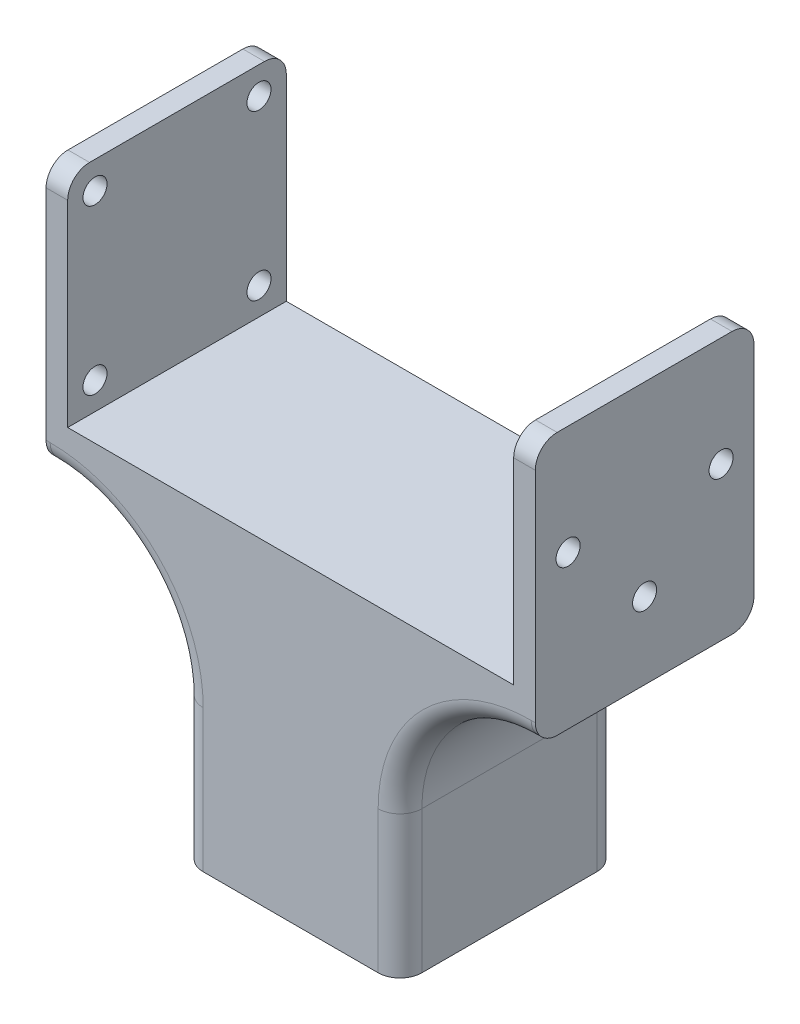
ISO-10303-21;
HEADER;
FILE_DESCRIPTION(('STEP AP214'),'2;1');
FILE_NAME('part.step','',(''),(''),'','','');
FILE_SCHEMA(('AUTOMOTIVE_DESIGN { 1 0 10303 214 1 1 1 1 }'));
ENDSEC;
DATA;
#1=APPLICATION_CONTEXT('core data for automotive mechanical design processes');
#2=APPLICATION_PROTOCOL_DEFINITION('international standard','automotive_design',2000,#1);
#3=PRODUCT_CONTEXT('',#1,'mechanical');
#4=PRODUCT('Part','Part','',(#3));
#5=PRODUCT_RELATED_PRODUCT_CATEGORY('part','',(#4));
#6=PRODUCT_DEFINITION_FORMATION('','',#4);
#7=PRODUCT_DEFINITION_CONTEXT('part definition',#1,'design');
#8=PRODUCT_DEFINITION('design','',#6,#7);
#9=PRODUCT_DEFINITION_SHAPE('','',#8);
#10=(LENGTH_UNIT() NAMED_UNIT(*) SI_UNIT(.MILLI.,.METRE.));
#11=(NAMED_UNIT(*) PLANE_ANGLE_UNIT() SI_UNIT($,.RADIAN.));
#12=(NAMED_UNIT(*) SI_UNIT($,.STERADIAN.) SOLID_ANGLE_UNIT());
#13=UNCERTAINTY_MEASURE_WITH_UNIT(LENGTH_MEASURE(1.E-05),#10,'distance_accuracy_value','');
#14=(GEOMETRIC_REPRESENTATION_CONTEXT(3) GLOBAL_UNCERTAINTY_ASSIGNED_CONTEXT((#13)) GLOBAL_UNIT_ASSIGNED_CONTEXT((#10,
#11,#12)) REPRESENTATION_CONTEXT('',''));
#15=CARTESIAN_POINT('',(0.,0.,0.));
#16=DIRECTION('',(0.,0.,1.));
#17=DIRECTION('',(1.,0.,0.));
#18=AXIS2_PLACEMENT_3D('',#15,#16,#17);
#19=CARTESIAN_POINT('',(0.,25.,0.));
#20=DIRECTION('',(0.,1.,0.));
#21=DIRECTION('',(1.,0.,0.));
#22=AXIS2_PLACEMENT_3D('',#19,#20,#21);
#23=PLANE('',#22);
#24=CARTESIAN_POINT('',(0.,25.,0.));
#25=DIRECTION('',(0.,-1.,0.));
#26=DIRECTION('',(1.,0.,0.));
#27=AXIS2_PLACEMENT_3D('',#24,#25,#26);
#28=CIRCLE('',#27,8.4);
#29=CARTESIAN_POINT('',(-8.4,25.,0.));
#30=VERTEX_POINT('',#29);
#31=EDGE_CURVE('E307',#30,#30,#28,.T.);
#32=ORIENTED_EDGE('',*,*,#31,.T.);
#33=EDGE_LOOP('',(#32));
#34=FACE_BOUND('',#33,.T.);
#35=ADVANCED_FACE('F15',(#34),#23,.F.);
#36=CARTESIAN_POINT('',(0.,49.,0.));
#37=DIRECTION('',(0.,1.,0.));
#38=DIRECTION('',(1.,0.,0.));
#39=AXIS2_PLACEMENT_3D('',#36,#37,#38);
#40=PLANE('',#39);
#41=DIRECTION('',(-1.,0.,0.));
#42=VECTOR('',#41,1.);
#43=CARTESIAN_POINT('',(-5.,49.,8.));
#44=LINE('',#43,#42);
#45=CARTESIAN_POINT('',(-20.4,49.,8.));
#46=VERTEX_POINT('',#45);
#47=CARTESIAN_POINT('',(-22.375,49.,8.));
#48=VERTEX_POINT('',#47);
#49=EDGE_CURVE('E421',#46,#48,#44,.T.);
#50=ORIENTED_EDGE('',*,*,#49,.F.);
#51=DIRECTION('',(0.,0.,-1.));
#52=VECTOR('',#51,1.);
#53=CARTESIAN_POINT('',(-20.4,49.,10.173540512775));
#54=LINE('',#53,#52);
#55=CARTESIAN_POINT('',(-20.4,49.,-8.));
#56=VERTEX_POINT('',#55);
#57=EDGE_CURVE('E10',#46,#56,#54,.T.);
#58=ORIENTED_EDGE('',*,*,#57,.T.);
#59=DIRECTION('',(1.,0.,0.));
#60=VECTOR('',#59,1.);
#61=CARTESIAN_POINT('',(5.,49.,-8.));
#62=LINE('',#61,#60);
#63=CARTESIAN_POINT('',(-22.375,49.,-8.));
#64=VERTEX_POINT('',#63);
#65=EDGE_CURVE('E350',#64,#56,#62,.T.);
#66=ORIENTED_EDGE('',*,*,#65,.F.);
#67=DIRECTION('',(0.,0.,1.));
#68=VECTOR('',#67,1.);
#69=CARTESIAN_POINT('',(-22.375,49.,-10.));
#70=LINE('',#69,#68);
#71=EDGE_CURVE('E577',#64,#48,#70,.T.);
#72=ORIENTED_EDGE('',*,*,#71,.T.);
#73=EDGE_LOOP('',(#50,#58,#66,#72));
#74=FACE_BOUND('',#73,.T.);
#75=ADVANCED_FACE('F1269',(#74),#40,.T.);
#76=CARTESIAN_POINT('',(0.,29.,0.));
#77=DIRECTION('',(0.,-1.,0.));
#78=DIRECTION('',(0.,0.,-1.));
#79=AXIS2_PLACEMENT_3D('',#76,#77,#78);
#80=PLANE('',#79);
#81=DIRECTION('',(1.,0.,0.));
#82=VECTOR('',#81,1.);
#83=CARTESIAN_POINT('',(5.,29.,-10.));
#84=LINE('',#83,#82);
#85=CARTESIAN_POINT('',(-20.4,29.,-10.));
#86=VERTEX_POINT('',#85);
#87=CARTESIAN_POINT('',(20.4,29.,-10.));
#88=VERTEX_POINT('',#87);
#89=EDGE_CURVE('E445',#86,#88,#84,.T.);
#90=ORIENTED_EDGE('',*,*,#89,.F.);
#91=DIRECTION('',(0.,0.,-1.));
#92=VECTOR('',#91,1.);
#93=CARTESIAN_POINT('',(-20.4,29.,-20.34708102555));
#94=LINE('',#93,#92);
#95=CARTESIAN_POINT('',(-20.4,29.,10.));
#96=VERTEX_POINT('',#95);
#97=EDGE_CURVE('E26',#96,#86,#94,.T.);
#98=ORIENTED_EDGE('',*,*,#97,.F.);
#99=DIRECTION('',(-1.,0.,0.));
#100=VECTOR('',#99,1.);
#101=CARTESIAN_POINT('',(-5.,29.,10.));
#102=LINE('',#101,#100);
#103=CARTESIAN_POINT('',(20.4,29.,10.));
#104=VERTEX_POINT('',#103);
#105=EDGE_CURVE('E498',#104,#96,#102,.T.);
#106=ORIENTED_EDGE('',*,*,#105,.F.);
#107=DIRECTION('',(0.,0.,1.));
#108=VECTOR('',#107,1.);
#109=CARTESIAN_POINT('',(20.4,29.,20.34708102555));
#110=LINE('',#109,#108);
#111=EDGE_CURVE('E347',#88,#104,#110,.T.);
#112=ORIENTED_EDGE('',*,*,#111,.F.);
#113=EDGE_LOOP('',(#90,#98,#106,#112));
#114=FACE_BOUND('',#113,.T.);
#115=ADVANCED_FACE('F874',(#114),#80,.F.);
#116=CARTESIAN_POINT('',(-20.4,49.,20.34708102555));
#117=DIRECTION('',(-1.,0.,0.));
#118=DIRECTION('',(0.,0.,1.));
#119=AXIS2_PLACEMENT_3D('',#116,#117,#118);
#120=PLANE('',#119);
#121=CARTESIAN_POINT('',(-20.4,31.5,7.5));
#122=DIRECTION('',(-1.,0.,0.));
#123=DIRECTION('',(0.,0.,1.));
#124=AXIS2_PLACEMENT_3D('',#121,#122,#123);
#125=CIRCLE('',#124,1.1);
#126=CARTESIAN_POINT('',(-20.4,31.5,6.4));
#127=VERTEX_POINT('',#126);
#128=EDGE_CURVE('E38',#127,#127,#125,.T.);
#129=ORIENTED_EDGE('',*,*,#128,.T.);
#130=EDGE_LOOP('',(#129));
#131=FACE_BOUND('',#130,.T.);
#132=CARTESIAN_POINT('',(-20.4,31.5,-7.5));
#133=DIRECTION('',(-1.,0.,0.));
#134=DIRECTION('',(0.,0.,1.));
#135=AXIS2_PLACEMENT_3D('',#132,#133,#134);
#136=CIRCLE('',#135,1.1);
#137=CARTESIAN_POINT('',(-20.4,31.5,-8.6));
#138=VERTEX_POINT('',#137);
#139=EDGE_CURVE('E589',#138,#138,#136,.T.);
#140=ORIENTED_EDGE('',*,*,#139,.T.);
#141=EDGE_LOOP('',(#140));
#142=FACE_BOUND('',#141,.T.);
#143=CARTESIAN_POINT('',(-20.4,46.5,-7.5));
#144=DIRECTION('',(-1.,0.,0.));
#145=DIRECTION('',(0.,0.,1.));
#146=AXIS2_PLACEMENT_3D('',#143,#144,#145);
#147=CIRCLE('',#146,1.1);
#148=CARTESIAN_POINT('',(-20.4,46.5,-8.6));
#149=VERTEX_POINT('',#148);
#150=EDGE_CURVE('E428',#149,#149,#147,.T.);
#151=ORIENTED_EDGE('',*,*,#150,.T.);
#152=EDGE_LOOP('',(#151));
#153=FACE_BOUND('',#152,.T.);
#154=CARTESIAN_POINT('',(-20.4,46.5,7.5));
#155=DIRECTION('',(-1.,0.,0.));
#156=DIRECTION('',(0.,0.,1.));
#157=AXIS2_PLACEMENT_3D('',#154,#155,#156);
#158=CIRCLE('',#157,1.1);
#159=CARTESIAN_POINT('',(-20.4,46.5,6.4));
#160=VERTEX_POINT('',#159);
#161=EDGE_CURVE('E463',#160,#160,#158,.T.);
#162=ORIENTED_EDGE('',*,*,#161,.T.);
#163=EDGE_LOOP('',(#162));
#164=FACE_BOUND('',#163,.T.);
#165=CARTESIAN_POINT('',(-20.4,47.,8.));
#166=DIRECTION('',(-1.,0.,0.));
#167=DIRECTION('',(0.,0.707106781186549,0.707106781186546));
#168=AXIS2_PLACEMENT_3D('',#165,#166,#167);
#169=CIRCLE('',#168,2.);
#170=CARTESIAN_POINT('',(-20.4,47.,10.));
#171=VERTEX_POINT('',#170);
#172=EDGE_CURVE('E489',#171,#46,#169,.T.);
#173=ORIENTED_EDGE('',*,*,#172,.F.);
#174=DIRECTION('',(0.,1.,0.));
#175=VECTOR('',#174,1.);
#176=CARTESIAN_POINT('',(-20.4,24.5,10.));
#177=LINE('',#176,#175);
#178=EDGE_CURVE('E502',#96,#171,#177,.T.);
#179=ORIENTED_EDGE('',*,*,#178,.F.);
#180=ORIENTED_EDGE('',*,*,#97,.T.);
#181=DIRECTION('',(0.,-1.,0.));
#182=VECTOR('',#181,1.);
#183=CARTESIAN_POINT('',(-20.4,24.5,-10.));
#184=LINE('',#183,#182);
#185=CARTESIAN_POINT('',(-20.4,47.,-10.));
#186=VERTEX_POINT('',#185);
#187=EDGE_CURVE('E531',#186,#86,#184,.T.);
#188=ORIENTED_EDGE('',*,*,#187,.F.);
#189=CARTESIAN_POINT('',(-20.4,47.,-8.));
#190=DIRECTION('',(-1.,0.,0.));
#191=DIRECTION('',(0.,0.707106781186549,-0.707106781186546));
#192=AXIS2_PLACEMENT_3D('',#189,#190,#191);
#193=CIRCLE('',#192,2.);
#194=EDGE_CURVE('E354',#56,#186,#193,.T.);
#195=ORIENTED_EDGE('',*,*,#194,.F.);
#196=ORIENTED_EDGE('',*,*,#57,.F.);
#197=EDGE_LOOP('',(#173,#179,#180,#188,#195,#196));
#198=FACE_BOUND('',#197,.T.);
#199=ADVANCED_FACE('F878',(#131,#142,#153,#164,#198),#120,.F.);
#200=CARTESIAN_POINT('',(20.4,49.,-20.34708102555));
#201=DIRECTION('',(1.,0.,0.));
#202=DIRECTION('',(0.,1.,0.));
#203=AXIS2_PLACEMENT_3D('',#200,#201,#202);
#204=PLANE('',#203);
#205=CARTESIAN_POINT('',(20.4,32.,0.));
#206=DIRECTION('',(1.,0.,0.));
#207=DIRECTION('',(0.,0.,-1.));
#208=AXIS2_PLACEMENT_3D('',#205,#206,#207);
#209=CIRCLE('',#208,1.1);
#210=CARTESIAN_POINT('',(20.4,32.,1.1));
#211=VERTEX_POINT('',#210);
#212=EDGE_CURVE('E330',#211,#211,#209,.T.);
#213=ORIENTED_EDGE('',*,*,#212,.T.);
#214=EDGE_LOOP('',(#213));
#215=FACE_BOUND('',#214,.T.);
#216=CARTESIAN_POINT('',(20.4,39.,7.));
#217=DIRECTION('',(1.,0.,0.));
#218=DIRECTION('',(0.,0.,-1.));
#219=AXIS2_PLACEMENT_3D('',#216,#217,#218);
#220=CIRCLE('',#219,1.1);
#221=CARTESIAN_POINT('',(20.4,39.,8.1));
#222=VERTEX_POINT('',#221);
#223=EDGE_CURVE('E331',#222,#222,#220,.T.);
#224=ORIENTED_EDGE('',*,*,#223,.T.);
#225=EDGE_LOOP('',(#224));
#226=FACE_BOUND('',#225,.T.);
#227=CARTESIAN_POINT('',(20.4,39.,-7.));
#228=DIRECTION('',(1.,0.,0.));
#229=DIRECTION('',(0.,0.,-1.));
#230=AXIS2_PLACEMENT_3D('',#227,#228,#229);
#231=CIRCLE('',#230,1.1);
#232=CARTESIAN_POINT('',(20.4,39.,-5.9));
#233=VERTEX_POINT('',#232);
#234=EDGE_CURVE('E387',#233,#233,#231,.T.);
#235=ORIENTED_EDGE('',*,*,#234,.T.);
#236=EDGE_LOOP('',(#235));
#237=FACE_BOUND('',#236,.T.);
#238=CARTESIAN_POINT('',(20.4,47.,8.));
#239=DIRECTION('',(1.,0.,0.));
#240=DIRECTION('',(0.,0.707106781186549,0.707106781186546));
#241=AXIS2_PLACEMENT_3D('',#238,#239,#240);
#242=CIRCLE('',#241,2.);
#243=CARTESIAN_POINT('',(20.4,49.,8.));
#244=VERTEX_POINT('',#243);
#245=CARTESIAN_POINT('',(20.4,47.,10.));
#246=VERTEX_POINT('',#245);
#247=EDGE_CURVE('E585',#244,#246,#242,.T.);
#248=ORIENTED_EDGE('',*,*,#247,.F.);
#249=DIRECTION('',(0.,0.,1.));
#250=VECTOR('',#249,1.);
#251=CARTESIAN_POINT('',(20.4,49.,-10.173540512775));
#252=LINE('',#251,#250);
#253=CARTESIAN_POINT('',(20.4,49.,-8.));
#254=VERTEX_POINT('',#253);
#255=EDGE_CURVE('E314',#254,#244,#252,.T.);
#256=ORIENTED_EDGE('',*,*,#255,.F.);
#257=CARTESIAN_POINT('',(20.4,47.,-8.));
#258=DIRECTION('',(1.,0.,0.));
#259=DIRECTION('',(0.,0.707106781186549,-0.707106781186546));
#260=AXIS2_PLACEMENT_3D('',#257,#258,#259);
#261=CIRCLE('',#260,2.);
#262=CARTESIAN_POINT('',(20.4,47.,-10.));
#263=VERTEX_POINT('',#262);
#264=EDGE_CURVE('E426',#263,#254,#261,.T.);
#265=ORIENTED_EDGE('',*,*,#264,.F.);
#266=DIRECTION('',(0.,1.,0.));
#267=VECTOR('',#266,1.);
#268=CARTESIAN_POINT('',(20.4,24.5,-10.));
#269=LINE('',#268,#267);
#270=EDGE_CURVE('E343',#88,#263,#269,.T.);
#271=ORIENTED_EDGE('',*,*,#270,.F.);
#272=ORIENTED_EDGE('',*,*,#111,.T.);
#273=DIRECTION('',(0.,-1.,0.));
#274=VECTOR('',#273,1.);
#275=CARTESIAN_POINT('',(20.4,24.5,10.));
#276=LINE('',#275,#274);
#277=EDGE_CURVE('E482',#246,#104,#276,.T.);
#278=ORIENTED_EDGE('',*,*,#277,.F.);
#279=EDGE_LOOP('',(#248,#256,#265,#271,#272,#278));
#280=FACE_BOUND('',#279,.T.);
#281=ADVANCED_FACE('F871',(#215,#226,#237,#280),#204,.F.);
#282=CARTESIAN_POINT('',(-22.375,31.5,7.5));
#283=DIRECTION('',(1.,0.,0.));
#284=DIRECTION('',(0.,0.,1.));
#285=AXIS2_PLACEMENT_3D('',#282,#283,#284);
#286=CYLINDRICAL_SURFACE('',#285,1.1);
#287=CARTESIAN_POINT('',(-22.375,31.5,7.5));
#288=DIRECTION('',(1.,0.,0.));
#289=DIRECTION('',(0.,0.,1.));
#290=AXIS2_PLACEMENT_3D('',#287,#288,#289);
#291=CIRCLE('',#290,1.1);
#292=CARTESIAN_POINT('',(-22.375,31.5,8.6));
#293=VERTEX_POINT('',#292);
#294=CARTESIAN_POINT('',(-22.375,31.5,6.4));
#295=VERTEX_POINT('',#294);
#296=EDGE_CURVE('E484',#293,#295,#291,.T.);
#297=ORIENTED_EDGE('',*,*,#296,.F.);
#298=CARTESIAN_POINT('',(-22.375,31.5,7.5));
#299=DIRECTION('',(1.,0.,0.));
#300=DIRECTION('',(0.,0.,1.));
#301=AXIS2_PLACEMENT_3D('',#298,#299,#300);
#302=CIRCLE('',#301,1.1);
#303=EDGE_CURVE('E355',#295,#293,#302,.T.);
#304=ORIENTED_EDGE('',*,*,#303,.F.);
#305=DIRECTION('',(1.,0.,0.));
#306=VECTOR('',#305,1.);
#307=CARTESIAN_POINT('',(-22.375,31.5,6.4));
#308=LINE('',#307,#306);
#309=EDGE_CURVE('E479',#295,#127,#308,.T.);
#310=ORIENTED_EDGE('',*,*,#309,.T.);
#311=ORIENTED_EDGE('',*,*,#128,.F.);
#312=ORIENTED_EDGE('',*,*,#309,.F.);
#313=EDGE_LOOP('',(#297,#304,#310,#311,#312));
#314=FACE_BOUND('',#313,.T.);
#315=ADVANCED_FACE('F1377',(#314),#286,.F.);
#316=CARTESIAN_POINT('',(-22.375,31.5,-7.5));
#317=DIRECTION('',(1.,0.,0.));
#318=DIRECTION('',(0.,0.,1.));
#319=AXIS2_PLACEMENT_3D('',#316,#317,#318);
#320=CYLINDRICAL_SURFACE('',#319,1.1);
#321=CARTESIAN_POINT('',(-22.375,31.5,-7.5));
#322=DIRECTION('',(1.,0.,0.));
#323=DIRECTION('',(0.,0.,1.));
#324=AXIS2_PLACEMENT_3D('',#321,#322,#323);
#325=CIRCLE('',#324,1.1);
#326=CARTESIAN_POINT('',(-22.375,31.5,-6.4));
#327=VERTEX_POINT('',#326);
#328=CARTESIAN_POINT('',(-22.375,31.5,-8.6));
#329=VERTEX_POINT('',#328);
#330=EDGE_CURVE('E546',#327,#329,#325,.T.);
#331=ORIENTED_EDGE('',*,*,#330,.F.);
#332=CARTESIAN_POINT('',(-22.375,31.5,-7.5));
#333=DIRECTION('',(1.,0.,0.));
#334=DIRECTION('',(0.,0.,1.));
#335=AXIS2_PLACEMENT_3D('',#332,#333,#334);
#336=CIRCLE('',#335,1.1);
#337=EDGE_CURVE('E488',#329,#327,#336,.T.);
#338=ORIENTED_EDGE('',*,*,#337,.F.);
#339=DIRECTION('',(1.,0.,0.));
#340=VECTOR('',#339,1.);
#341=CARTESIAN_POINT('',(-22.375,31.5,-8.6));
#342=LINE('',#341,#340);
#343=EDGE_CURVE('E432',#329,#138,#342,.T.);
#344=ORIENTED_EDGE('',*,*,#343,.T.);
#345=ORIENTED_EDGE('',*,*,#139,.F.);
#346=ORIENTED_EDGE('',*,*,#343,.F.);
#347=EDGE_LOOP('',(#331,#338,#344,#345,#346));
#348=FACE_BOUND('',#347,.T.);
#349=ADVANCED_FACE('F1158',(#348),#320,.F.);
#350=CARTESIAN_POINT('',(-22.375,46.5,-7.5));
#351=DIRECTION('',(1.,0.,0.));
#352=DIRECTION('',(0.,0.,1.));
#353=AXIS2_PLACEMENT_3D('',#350,#351,#352);
#354=CYLINDRICAL_SURFACE('',#353,1.1);
#355=CARTESIAN_POINT('',(-22.375,46.5,-7.5));
#356=DIRECTION('',(1.,0.,0.));
#357=DIRECTION('',(0.,0.,1.));
#358=AXIS2_PLACEMENT_3D('',#355,#356,#357);
#359=CIRCLE('',#358,1.1);
#360=CARTESIAN_POINT('',(-22.375,46.5,-6.4));
#361=VERTEX_POINT('',#360);
#362=CARTESIAN_POINT('',(-22.375,46.5,-8.6));
#363=VERTEX_POINT('',#362);
#364=EDGE_CURVE('E372',#361,#363,#359,.T.);
#365=ORIENTED_EDGE('',*,*,#364,.F.);
#366=CARTESIAN_POINT('',(-22.375,46.5,-7.5));
#367=DIRECTION('',(1.,0.,0.));
#368=DIRECTION('',(0.,0.,1.));
#369=AXIS2_PLACEMENT_3D('',#366,#367,#368);
#370=CIRCLE('',#369,1.1);
#371=EDGE_CURVE('E376',#363,#361,#370,.T.);
#372=ORIENTED_EDGE('',*,*,#371,.F.);
#373=DIRECTION('',(1.,0.,0.));
#374=VECTOR('',#373,1.);
#375=CARTESIAN_POINT('',(-22.375,46.5,-8.6));
#376=LINE('',#375,#374);
#377=EDGE_CURVE('E433',#363,#149,#376,.T.);
#378=ORIENTED_EDGE('',*,*,#377,.T.);
#379=ORIENTED_EDGE('',*,*,#150,.F.);
#380=ORIENTED_EDGE('',*,*,#377,.F.);
#381=EDGE_LOOP('',(#365,#372,#378,#379,#380));
#382=FACE_BOUND('',#381,.T.);
#383=ADVANCED_FACE('F1151',(#382),#354,.F.);
#384=CARTESIAN_POINT('',(-22.375,46.5,7.5));
#385=DIRECTION('',(1.,0.,0.));
#386=DIRECTION('',(0.,0.,1.));
#387=AXIS2_PLACEMENT_3D('',#384,#385,#386);
#388=CYLINDRICAL_SURFACE('',#387,1.1);
#389=CARTESIAN_POINT('',(-22.375,46.5,7.5));
#390=DIRECTION('',(1.,0.,0.));
#391=DIRECTION('',(0.,0.,1.));
#392=AXIS2_PLACEMENT_3D('',#389,#390,#391);
#393=CIRCLE('',#392,1.1);
#394=CARTESIAN_POINT('',(-22.375,46.5,8.6));
#395=VERTEX_POINT('',#394);
#396=CARTESIAN_POINT('',(-22.375,46.5,6.4));
#397=VERTEX_POINT('',#396);
#398=EDGE_CURVE('E595',#395,#397,#393,.T.);
#399=ORIENTED_EDGE('',*,*,#398,.F.);
#400=CARTESIAN_POINT('',(-22.375,46.5,7.5));
#401=DIRECTION('',(1.,0.,0.));
#402=DIRECTION('',(0.,0.,1.));
#403=AXIS2_PLACEMENT_3D('',#400,#401,#402);
#404=CIRCLE('',#403,1.1);
#405=EDGE_CURVE('E377',#397,#395,#404,.T.);
#406=ORIENTED_EDGE('',*,*,#405,.F.);
#407=DIRECTION('',(1.,0.,0.));
#408=VECTOR('',#407,1.);
#409=CARTESIAN_POINT('',(-22.375,46.5,6.4));
#410=LINE('',#409,#408);
#411=EDGE_CURVE('E408',#397,#160,#410,.T.);
#412=ORIENTED_EDGE('',*,*,#411,.T.);
#413=ORIENTED_EDGE('',*,*,#161,.F.);
#414=ORIENTED_EDGE('',*,*,#411,.F.);
#415=EDGE_LOOP('',(#399,#406,#412,#413,#414));
#416=FACE_BOUND('',#415,.T.);
#417=ADVANCED_FACE('F1157',(#416),#388,.F.);
#418=CARTESIAN_POINT('',(22.375,32.,0.));
#419=DIRECTION('',(-1.,0.,0.));
#420=DIRECTION('',(0.,0.,-1.));
#421=AXIS2_PLACEMENT_3D('',#418,#419,#420);
#422=CYLINDRICAL_SURFACE('',#421,1.1);
#423=CARTESIAN_POINT('',(22.375,32.,0.));
#424=DIRECTION('',(-1.,0.,0.));
#425=DIRECTION('',(0.,0.,-1.));
#426=AXIS2_PLACEMENT_3D('',#423,#424,#425);
#427=CIRCLE('',#426,1.1);
#428=CARTESIAN_POINT('',(22.375,32.,-1.1));
#429=VERTEX_POINT('',#428);
#430=CARTESIAN_POINT('',(22.375,32.,1.1));
#431=VERTEX_POINT('',#430);
#432=EDGE_CURVE('E427',#429,#431,#427,.T.);
#433=ORIENTED_EDGE('',*,*,#432,.F.);
#434=CARTESIAN_POINT('',(22.375,32.,0.));
#435=DIRECTION('',(-1.,0.,0.));
#436=DIRECTION('',(0.,0.,-1.));
#437=AXIS2_PLACEMENT_3D('',#434,#435,#436);
#438=CIRCLE('',#437,1.1);
#439=EDGE_CURVE('E422',#431,#429,#438,.T.);
#440=ORIENTED_EDGE('',*,*,#439,.F.);
#441=DIRECTION('',(-1.,0.,0.));
#442=VECTOR('',#441,1.);
#443=CARTESIAN_POINT('',(22.375,32.,1.1));
#444=LINE('',#443,#442);
#445=EDGE_CURVE('E326',#431,#211,#444,.T.);
#446=ORIENTED_EDGE('',*,*,#445,.T.);
#447=ORIENTED_EDGE('',*,*,#212,.F.);
#448=ORIENTED_EDGE('',*,*,#445,.F.);
#449=EDGE_LOOP('',(#433,#440,#446,#447,#448));
#450=FACE_BOUND('',#449,.T.);
#451=ADVANCED_FACE('F1243',(#450),#422,.F.);
#452=CARTESIAN_POINT('',(22.375,39.,7.));
#453=DIRECTION('',(-1.,0.,0.));
#454=DIRECTION('',(0.,0.,-1.));
#455=AXIS2_PLACEMENT_3D('',#452,#453,#454);
#456=CYLINDRICAL_SURFACE('',#455,1.1);
#457=CARTESIAN_POINT('',(22.375,39.,7.));
#458=DIRECTION('',(-1.,0.,0.));
#459=DIRECTION('',(0.,0.,-1.));
#460=AXIS2_PLACEMENT_3D('',#457,#458,#459);
#461=CIRCLE('',#460,1.1);
#462=CARTESIAN_POINT('',(22.375,39.,5.9));
#463=VERTEX_POINT('',#462);
#464=CARTESIAN_POINT('',(22.375,39.,8.1));
#465=VERTEX_POINT('',#464);
#466=EDGE_CURVE('E653',#463,#465,#461,.T.);
#467=ORIENTED_EDGE('',*,*,#466,.F.);
#468=CARTESIAN_POINT('',(22.375,39.,7.));
#469=DIRECTION('',(-1.,0.,0.));
#470=DIRECTION('',(0.,0.,-1.));
#471=AXIS2_PLACEMENT_3D('',#468,#469,#470);
#472=CIRCLE('',#471,1.1);
#473=EDGE_CURVE('E649',#465,#463,#472,.T.);
#474=ORIENTED_EDGE('',*,*,#473,.F.);
#475=DIRECTION('',(-1.,0.,0.));
#476=VECTOR('',#475,1.);
#477=CARTESIAN_POINT('',(22.375,39.,8.1));
#478=LINE('',#477,#476);
#479=EDGE_CURVE('E390',#465,#222,#478,.T.);
#480=ORIENTED_EDGE('',*,*,#479,.T.);
#481=ORIENTED_EDGE('',*,*,#223,.F.);
#482=ORIENTED_EDGE('',*,*,#479,.F.);
#483=EDGE_LOOP('',(#467,#474,#480,#481,#482));
#484=FACE_BOUND('',#483,.T.);
#485=ADVANCED_FACE('F1219',(#484),#456,.F.);
#486=CARTESIAN_POINT('',(22.375,39.,-7.));
#487=DIRECTION('',(-1.,0.,0.));
#488=DIRECTION('',(0.,0.,-1.));
#489=AXIS2_PLACEMENT_3D('',#486,#487,#488);
#490=CYLINDRICAL_SURFACE('',#489,1.1);
#491=CARTESIAN_POINT('',(22.375,39.,-7.));
#492=DIRECTION('',(-1.,0.,0.));
#493=DIRECTION('',(0.,0.,-1.));
#494=AXIS2_PLACEMENT_3D('',#491,#492,#493);
#495=CIRCLE('',#494,1.1);
#496=CARTESIAN_POINT('',(22.375,39.,-8.1));
#497=VERTEX_POINT('',#496);
#498=CARTESIAN_POINT('',(22.375,39.,-5.9));
#499=VERTEX_POINT('',#498);
#500=EDGE_CURVE('E370',#497,#499,#495,.T.);
#501=ORIENTED_EDGE('',*,*,#500,.F.);
#502=CARTESIAN_POINT('',(22.375,39.,-7.));
#503=DIRECTION('',(-1.,0.,0.));
#504=DIRECTION('',(0.,0.,-1.));
#505=AXIS2_PLACEMENT_3D('',#502,#503,#504);
#506=CIRCLE('',#505,1.1);
#507=EDGE_CURVE('E473',#499,#497,#506,.T.);
#508=ORIENTED_EDGE('',*,*,#507,.F.);
#509=DIRECTION('',(-1.,0.,0.));
#510=VECTOR('',#509,1.);
#511=CARTESIAN_POINT('',(22.375,39.,-5.9));
#512=LINE('',#511,#510);
#513=EDGE_CURVE('E391',#499,#233,#512,.T.);
#514=ORIENTED_EDGE('',*,*,#513,.T.);
#515=ORIENTED_EDGE('',*,*,#234,.F.);
#516=ORIENTED_EDGE('',*,*,#513,.F.);
#517=EDGE_LOOP('',(#501,#508,#514,#515,#516));
#518=FACE_BOUND('',#517,.T.);
#519=ADVANCED_FACE('F1213',(#518),#490,.F.);
#520=CARTESIAN_POINT('',(8.,0.,-8.));
#521=DIRECTION('',(0.,1.,0.));
#522=DIRECTION('',(0.707106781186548,0.,-0.707106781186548));
#523=AXIS2_PLACEMENT_3D('',#520,#521,#522);
#524=CYLINDRICAL_SURFACE('',#523,2.);
#525=CARTESIAN_POINT('',(8.,0.,-8.));
#526=DIRECTION('',(0.,1.,0.));
#527=DIRECTION('',(0.707106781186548,0.,-0.707106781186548));
#528=AXIS2_PLACEMENT_3D('',#525,#526,#527);
#529=CIRCLE('',#528,2.);
#530=CARTESIAN_POINT('',(10.,0.,-8.));
#531=VERTEX_POINT('',#530);
#532=CARTESIAN_POINT('',(8.,0.,-10.));
#533=VERTEX_POINT('',#532);
#534=EDGE_CURVE('E356',#531,#533,#529,.T.);
#535=ORIENTED_EDGE('',*,*,#534,.T.);
#536=DIRECTION('',(0.,1.,0.));
#537=VECTOR('',#536,1.);
#538=CARTESIAN_POINT('',(8.,0.,-10.));
#539=LINE('',#538,#537);
#540=CARTESIAN_POINT('',(8.,13.,-10.));
#541=VERTEX_POINT('',#540);
#542=EDGE_CURVE('E303',#533,#541,#539,.T.);
#543=ORIENTED_EDGE('',*,*,#542,.T.);
#544=CARTESIAN_POINT('',(8.,13.,-8.));
#545=DIRECTION('',(0.,1.,0.));
#546=DIRECTION('',(1.,0.,0.));
#547=AXIS2_PLACEMENT_3D('',#544,#545,#546);
#548=CIRCLE('',#547,2.);
#549=CARTESIAN_POINT('',(10.,13.,-8.));
#550=VERTEX_POINT('',#549);
#551=EDGE_CURVE('E381',#550,#541,#548,.T.);
#552=ORIENTED_EDGE('',*,*,#551,.F.);
#553=DIRECTION('',(0.,-1.,0.));
#554=VECTOR('',#553,1.);
#555=CARTESIAN_POINT('',(10.,0.,-8.));
#556=LINE('',#555,#554);
#557=EDGE_CURVE('E535',#550,#531,#556,.T.);
#558=ORIENTED_EDGE('',*,*,#557,.T.);
#559=EDGE_LOOP('',(#535,#543,#552,#558));
#560=FACE_BOUND('',#559,.T.);
#561=ADVANCED_FACE('F1218',(#560),#524,.T.);
#562=CARTESIAN_POINT('',(22.,13.,-8.));
#563=DIRECTION('',(0.,0.,-1.));
#564=DIRECTION('',(-1.,0.,0.));
#565=AXIS2_PLACEMENT_3D('',#562,#563,#564);
#566=TOROIDAL_SURFACE('',#565,14.,2.);
#567=ORIENTED_EDGE('',*,*,#551,.T.);
#568=CARTESIAN_POINT('',(22.,13.,-10.));
#569=DIRECTION('',(0.,0.,-1.));
#570=DIRECTION('',(-0.707106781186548,0.707106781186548,0.));
#571=AXIS2_PLACEMENT_3D('',#568,#569,#570);
#572=CIRCLE('',#571,14.);
#573=CARTESIAN_POINT('',(22.,27.,-10.));
#574=VERTEX_POINT('',#573);
#575=EDGE_CURVE('E386',#541,#574,#572,.T.);
#576=ORIENTED_EDGE('',*,*,#575,.T.);
#577=CARTESIAN_POINT('',(22.,27.,-8.));
#578=DIRECTION('',(1.,0.,0.));
#579=DIRECTION('',(0.,-1.,0.));
#580=AXIS2_PLACEMENT_3D('',#577,#578,#579);
#581=CIRCLE('',#580,2.);
#582=CARTESIAN_POINT('',(22.,25.,-8.));
#583=VERTEX_POINT('',#582);
#584=EDGE_CURVE('E378',#583,#574,#581,.T.);
#585=ORIENTED_EDGE('',*,*,#584,.F.);
#586=CARTESIAN_POINT('',(22.,13.,-8.));
#587=DIRECTION('',(0.,0.,1.));
#588=DIRECTION('',(-0.707106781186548,0.707106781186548,0.));
#589=AXIS2_PLACEMENT_3D('',#586,#587,#588);
#590=CIRCLE('',#589,12.);
#591=EDGE_CURVE('E538',#583,#550,#590,.T.);
#592=ORIENTED_EDGE('',*,*,#591,.T.);
#593=EDGE_LOOP('',(#567,#576,#585,#592));
#594=FACE_BOUND('',#593,.T.);
#595=ADVANCED_FACE('F1183',(#594),#566,.T.);
#596=CARTESIAN_POINT('',(5.,27.,-8.));
#597=DIRECTION('',(-1.,0.,0.));
#598=DIRECTION('',(0.,-0.707106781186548,-0.707106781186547));
#599=AXIS2_PLACEMENT_3D('',#596,#597,#598);
#600=CYLINDRICAL_SURFACE('',#599,2.);
#601=CARTESIAN_POINT('',(22.375,27.,-8.));
#602=DIRECTION('',(-1.,0.,0.));
#603=DIRECTION('',(0.,-0.707106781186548,-0.707106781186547));
#604=AXIS2_PLACEMENT_3D('',#601,#602,#603);
#605=CIRCLE('',#604,2.);
#606=CARTESIAN_POINT('',(22.375,27.,-10.));
#607=VERTEX_POINT('',#606);
#608=CARTESIAN_POINT('',(22.375,25.,-8.));
#609=VERTEX_POINT('',#608);
#610=EDGE_CURVE('E371',#607,#609,#605,.T.);
#611=ORIENTED_EDGE('',*,*,#610,.T.);
#612=DIRECTION('',(-1.,0.,0.));
#613=VECTOR('',#612,1.);
#614=CARTESIAN_POINT('',(5.,25.,-8.));
#615=LINE('',#614,#613);
#616=EDGE_CURVE('E397',#609,#583,#615,.T.);
#617=ORIENTED_EDGE('',*,*,#616,.T.);
#618=ORIENTED_EDGE('',*,*,#584,.T.);
#619=DIRECTION('',(1.,0.,0.));
#620=VECTOR('',#619,1.);
#621=CARTESIAN_POINT('',(5.,27.,-10.));
#622=LINE('',#621,#620);
#623=EDGE_CURVE('E382',#574,#607,#622,.T.);
#624=ORIENTED_EDGE('',*,*,#623,.T.);
#625=EDGE_LOOP('',(#611,#617,#618,#624));
#626=FACE_BOUND('',#625,.T.);
#627=ADVANCED_FACE('F850',(#626),#600,.T.);
#628=CARTESIAN_POINT('',(-10.,0.,-10.));
#629=DIRECTION('',(-1.,0.,0.));
#630=DIRECTION('',(0.,0.,1.));
#631=AXIS2_PLACEMENT_3D('',#628,#629,#630);
#632=PLANE('',#631);
#633=DIRECTION('',(0.,-1.,0.));
#634=VECTOR('',#633,1.);
#635=CARTESIAN_POINT('',(-10.,0.,8.));
#636=LINE('',#635,#634);
#637=CARTESIAN_POINT('',(-10.,13.,8.));
#638=VERTEX_POINT('',#637);
#639=CARTESIAN_POINT('',(-10.,0.,8.));
#640=VERTEX_POINT('',#639);
#641=EDGE_CURVE('E468',#638,#640,#636,.T.);
#642=ORIENTED_EDGE('',*,*,#641,.F.);
#643=DIRECTION('',(0.,0.,1.));
#644=VECTOR('',#643,1.);
#645=CARTESIAN_POINT('',(-10.,13.,-5.));
#646=LINE('',#645,#644);
#647=CARTESIAN_POINT('',(-10.,13.,-8.));
#648=VERTEX_POINT('',#647);
#649=EDGE_CURVE('E324',#648,#638,#646,.T.);
#650=ORIENTED_EDGE('',*,*,#649,.F.);
#651=DIRECTION('',(0.,1.,0.));
#652=VECTOR('',#651,1.);
#653=CARTESIAN_POINT('',(-10.,0.,-8.));
#654=LINE('',#653,#652);
#655=CARTESIAN_POINT('',(-10.,0.,-8.));
#656=VERTEX_POINT('',#655);
#657=EDGE_CURVE('E277',#656,#648,#654,.T.);
#658=ORIENTED_EDGE('',*,*,#657,.F.);
#659=DIRECTION('',(0.,0.,1.));
#660=VECTOR('',#659,1.);
#661=CARTESIAN_POINT('',(-10.,0.,-10.));
#662=LINE('',#661,#660);
#663=EDGE_CURVE('E458',#656,#640,#662,.T.);
#664=ORIENTED_EDGE('',*,*,#663,.T.);
#665=EDGE_LOOP('',(#642,#650,#658,#664));
#666=FACE_BOUND('',#665,.T.);
#667=ADVANCED_FACE('F717',(#666),#632,.T.);
#668=CARTESIAN_POINT('',(-22.,13.,-5.));
#669=DIRECTION('',(0.,0.,1.));
#670=DIRECTION('',(0.707106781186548,0.707106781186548,0.));
#671=AXIS2_PLACEMENT_3D('',#668,#669,#670);
#672=CYLINDRICAL_SURFACE('',#671,12.);
#673=CARTESIAN_POINT('',(-22.,13.,8.));
#674=DIRECTION('',(0.,0.,-1.));
#675=DIRECTION('',(0.707106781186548,0.707106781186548,0.));
#676=AXIS2_PLACEMENT_3D('',#673,#674,#675);
#677=CIRCLE('',#676,12.);
#678=CARTESIAN_POINT('',(-22.,25.,8.));
#679=VERTEX_POINT('',#678);
#680=EDGE_CURVE('E511',#679,#638,#677,.T.);
#681=ORIENTED_EDGE('',*,*,#680,.F.);
#682=DIRECTION('',(0.,0.,-1.));
#683=VECTOR('',#682,1.);
#684=CARTESIAN_POINT('',(-22.,25.,-5.));
#685=LINE('',#684,#683);
#686=CARTESIAN_POINT('',(-22.,25.,-8.));
#687=VERTEX_POINT('',#686);
#688=EDGE_CURVE('E321',#679,#687,#685,.T.);
#689=ORIENTED_EDGE('',*,*,#688,.T.);
#690=CARTESIAN_POINT('',(-22.,13.,-8.));
#691=DIRECTION('',(0.,0.,1.));
#692=DIRECTION('',(0.707106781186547,0.707106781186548,0.));
#693=AXIS2_PLACEMENT_3D('',#690,#691,#692);
#694=CIRCLE('',#693,12.);
#695=EDGE_CURVE('E346',#648,#687,#694,.T.);
#696=ORIENTED_EDGE('',*,*,#695,.F.);
#697=ORIENTED_EDGE('',*,*,#649,.T.);
#698=EDGE_LOOP('',(#681,#689,#696,#697));
#699=FACE_BOUND('',#698,.T.);
#700=ADVANCED_FACE('F1329',(#699),#672,.F.);
#701=CARTESIAN_POINT('',(0.,25.,0.));
#702=DIRECTION('',(0.,1.,0.));
#703=DIRECTION('',(1.,0.,0.));
#704=AXIS2_PLACEMENT_3D('',#701,#702,#703);
#705=PLANE('',#704);
#706=DIRECTION('',(1.,0.,0.));
#707=VECTOR('',#706,1.);
#708=CARTESIAN_POINT('',(-5.,25.,8.));
#709=LINE('',#708,#707);
#710=CARTESIAN_POINT('',(-22.375,25.,8.));
#711=VERTEX_POINT('',#710);
#712=EDGE_CURVE('E515',#711,#679,#709,.T.);
#713=ORIENTED_EDGE('',*,*,#712,.F.);
#714=DIRECTION('',(0.,0.,1.));
#715=VECTOR('',#714,1.);
#716=CARTESIAN_POINT('',(-22.375,25.,-10.));
#717=LINE('',#716,#715);
#718=CARTESIAN_POINT('',(-22.375,25.,-8.));
#719=VERTEX_POINT('',#718);
#720=EDGE_CURVE('E604',#719,#711,#717,.T.);
#721=ORIENTED_EDGE('',*,*,#720,.F.);
#722=DIRECTION('',(-1.,0.,0.));
#723=VECTOR('',#722,1.);
#724=CARTESIAN_POINT('',(5.,25.,-8.));
#725=LINE('',#724,#723);
#726=EDGE_CURVE('E325',#687,#719,#725,.T.);
#727=ORIENTED_EDGE('',*,*,#726,.F.);
#728=ORIENTED_EDGE('',*,*,#688,.F.);
#729=EDGE_LOOP('',(#713,#721,#727,#728));
#730=FACE_BOUND('',#729,.T.);
#731=ADVANCED_FACE('F1324',(#730),#705,.F.);
#732=CARTESIAN_POINT('',(5.,27.,-8.));
#733=DIRECTION('',(-1.,0.,0.));
#734=DIRECTION('',(0.,-0.707106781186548,-0.707106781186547));
#735=AXIS2_PLACEMENT_3D('',#732,#733,#734);
#736=CYLINDRICAL_SURFACE('',#735,2.);
#737=CARTESIAN_POINT('',(-22.375,27.,-8.));
#738=DIRECTION('',(1.,0.,0.));
#739=DIRECTION('',(0.,-0.707106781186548,-0.707106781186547));
#740=AXIS2_PLACEMENT_3D('',#737,#738,#739);
#741=CIRCLE('',#740,2.);
#742=CARTESIAN_POINT('',(-22.375,27.,-10.));
#743=VERTEX_POINT('',#742);
#744=EDGE_CURVE('E615',#719,#743,#741,.T.);
#745=ORIENTED_EDGE('',*,*,#744,.T.);
#746=DIRECTION('',(1.,0.,0.));
#747=VECTOR('',#746,1.);
#748=CARTESIAN_POINT('',(5.,27.,-10.));
#749=LINE('',#748,#747);
#750=CARTESIAN_POINT('',(-22.,27.,-10.));
#751=VERTEX_POINT('',#750);
#752=EDGE_CURVE('E290',#743,#751,#749,.T.);
#753=ORIENTED_EDGE('',*,*,#752,.T.);
#754=CARTESIAN_POINT('',(-22.,27.,-8.));
#755=DIRECTION('',(1.,0.,0.));
#756=DIRECTION('',(0.,-1.,0.));
#757=AXIS2_PLACEMENT_3D('',#754,#755,#756);
#758=CIRCLE('',#757,2.);
#759=EDGE_CURVE('E281',#687,#751,#758,.T.);
#760=ORIENTED_EDGE('',*,*,#759,.F.);
#761=ORIENTED_EDGE('',*,*,#726,.T.);
#762=EDGE_LOOP('',(#745,#753,#760,#761));
#763=FACE_BOUND('',#762,.T.);
#764=ADVANCED_FACE('F1317',(#763),#736,.T.);
#765=CARTESIAN_POINT('',(-22.,13.,-8.));
#766=DIRECTION('',(0.,0.,-1.));
#767=DIRECTION('',(-1.,0.,0.));
#768=AXIS2_PLACEMENT_3D('',#765,#766,#767);
#769=TOROIDAL_SURFACE('',#768,14.,2.);
#770=ORIENTED_EDGE('',*,*,#759,.T.);
#771=CARTESIAN_POINT('',(-22.,13.,-10.));
#772=DIRECTION('',(0.,0.,-1.));
#773=DIRECTION('',(0.707106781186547,0.707106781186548,0.));
#774=AXIS2_PLACEMENT_3D('',#771,#772,#773);
#775=CIRCLE('',#774,14.);
#776=CARTESIAN_POINT('',(-8.,13.,-10.));
#777=VERTEX_POINT('',#776);
#778=EDGE_CURVE('E284',#751,#777,#775,.T.);
#779=ORIENTED_EDGE('',*,*,#778,.T.);
#780=CARTESIAN_POINT('',(-8.,13.,-8.));
#781=DIRECTION('',(0.,-1.,0.));
#782=DIRECTION('',(-1.,0.,0.));
#783=AXIS2_PLACEMENT_3D('',#780,#781,#782);
#784=CIRCLE('',#783,2.);
#785=EDGE_CURVE('E270',#648,#777,#784,.T.);
#786=ORIENTED_EDGE('',*,*,#785,.F.);
#787=ORIENTED_EDGE('',*,*,#695,.T.);
#788=EDGE_LOOP('',(#770,#779,#786,#787));
#789=FACE_BOUND('',#788,.T.);
#790=ADVANCED_FACE('F285',(#789),#769,.T.);
#791=CARTESIAN_POINT('',(-8.,0.,-8.));
#792=DIRECTION('',(0.,1.,0.));
#793=DIRECTION('',(-0.707106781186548,0.,-0.707106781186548));
#794=AXIS2_PLACEMENT_3D('',#791,#792,#793);
#795=CYLINDRICAL_SURFACE('',#794,2.);
#796=CARTESIAN_POINT('',(-8.,0.,-8.));
#797=DIRECTION('',(0.,1.,0.));
#798=DIRECTION('',(-0.707106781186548,0.,-0.707106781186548));
#799=AXIS2_PLACEMENT_3D('',#796,#797,#798);
#800=CIRCLE('',#799,2.);
#801=CARTESIAN_POINT('',(-8.,0.,-10.));
#802=VERTEX_POINT('',#801);
#803=EDGE_CURVE('E359',#802,#656,#800,.T.);
#804=ORIENTED_EDGE('',*,*,#803,.T.);
#805=ORIENTED_EDGE('',*,*,#657,.T.);
#806=ORIENTED_EDGE('',*,*,#785,.T.);
#807=DIRECTION('',(0.,-1.,0.));
#808=VECTOR('',#807,1.);
#809=CARTESIAN_POINT('',(-8.,0.,-10.));
#810=LINE('',#809,#808);
#811=EDGE_CURVE('E275',#777,#802,#810,.T.);
#812=ORIENTED_EDGE('',*,*,#811,.T.);
#813=EDGE_LOOP('',(#804,#805,#806,#812));
#814=FACE_BOUND('',#813,.T.);
#815=ADVANCED_FACE('F273',(#814),#795,.T.);
#816=CARTESIAN_POINT('',(10.,0.,10.));
#817=DIRECTION('',(1.,0.,0.));
#818=DIRECTION('',(0.,1.,0.));
#819=AXIS2_PLACEMENT_3D('',#816,#817,#818);
#820=PLANE('',#819);
#821=DIRECTION('',(0.,1.,0.));
#822=VECTOR('',#821,1.);
#823=CARTESIAN_POINT('',(10.,0.,8.));
#824=LINE('',#823,#822);
#825=CARTESIAN_POINT('',(10.,0.,8.));
#826=VERTEX_POINT('',#825);
#827=CARTESIAN_POINT('',(10.,13.,8.));
#828=VERTEX_POINT('',#827);
#829=EDGE_CURVE('E568',#826,#828,#824,.T.);
#830=ORIENTED_EDGE('',*,*,#829,.F.);
#831=DIRECTION('',(0.,0.,-1.));
#832=VECTOR('',#831,1.);
#833=CARTESIAN_POINT('',(10.,0.,10.));
#834=LINE('',#833,#832);
#835=EDGE_CURVE('E358',#826,#531,#834,.T.);
#836=ORIENTED_EDGE('',*,*,#835,.T.);
#837=ORIENTED_EDGE('',*,*,#557,.F.);
#838=DIRECTION('',(0.,0.,-1.));
#839=VECTOR('',#838,1.);
#840=CARTESIAN_POINT('',(10.,13.,5.));
#841=LINE('',#840,#839);
#842=EDGE_CURVE('E401',#828,#550,#841,.T.);
#843=ORIENTED_EDGE('',*,*,#842,.F.);
#844=EDGE_LOOP('',(#830,#836,#837,#843));
#845=FACE_BOUND('',#844,.T.);
#846=ADVANCED_FACE('F843',(#845),#820,.T.);
#847=CARTESIAN_POINT('',(22.,13.,5.));
#848=DIRECTION('',(0.,0.,-1.));
#849=DIRECTION('',(-0.707106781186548,0.707106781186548,0.));
#850=AXIS2_PLACEMENT_3D('',#847,#848,#849);
#851=CYLINDRICAL_SURFACE('',#850,12.);
#852=CARTESIAN_POINT('',(22.,13.,8.));
#853=DIRECTION('',(0.,0.,-1.));
#854=DIRECTION('',(-0.707106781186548,0.707106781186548,0.));
#855=AXIS2_PLACEMENT_3D('',#852,#853,#854);
#856=CIRCLE('',#855,12.);
#857=CARTESIAN_POINT('',(22.,25.,8.));
#858=VERTEX_POINT('',#857);
#859=EDGE_CURVE('E497',#828,#858,#856,.T.);
#860=ORIENTED_EDGE('',*,*,#859,.F.);
#861=ORIENTED_EDGE('',*,*,#842,.T.);
#862=ORIENTED_EDGE('',*,*,#591,.F.);
#863=DIRECTION('',(0.,0.,1.));
#864=VECTOR('',#863,1.);
#865=CARTESIAN_POINT('',(22.,25.,5.));
#866=LINE('',#865,#864);
#867=EDGE_CURVE('E402',#583,#858,#866,.T.);
#868=ORIENTED_EDGE('',*,*,#867,.T.);
#869=EDGE_LOOP('',(#860,#861,#862,#868));
#870=FACE_BOUND('',#869,.T.);
#871=ADVANCED_FACE('F847',(#870),#851,.F.);
#872=CARTESIAN_POINT('',(0.,25.,0.));
#873=DIRECTION('',(0.,1.,0.));
#874=DIRECTION('',(1.,0.,0.));
#875=AXIS2_PLACEMENT_3D('',#872,#873,#874);
#876=PLANE('',#875);
#877=DIRECTION('',(1.,0.,0.));
#878=VECTOR('',#877,1.);
#879=CARTESIAN_POINT('',(-5.,25.,8.));
#880=LINE('',#879,#878);
#881=CARTESIAN_POINT('',(22.375,25.,8.));
#882=VERTEX_POINT('',#881);
#883=EDGE_CURVE('E493',#858,#882,#880,.T.);
#884=ORIENTED_EDGE('',*,*,#883,.F.);
#885=ORIENTED_EDGE('',*,*,#867,.F.);
#886=ORIENTED_EDGE('',*,*,#616,.F.);
#887=DIRECTION('',(0.,0.,-1.));
#888=VECTOR('',#887,1.);
#889=CARTESIAN_POINT('',(22.375,25.,10.));
#890=LINE('',#889,#888);
#891=EDGE_CURVE('E313',#882,#609,#890,.T.);
#892=ORIENTED_EDGE('',*,*,#891,.F.);
#893=EDGE_LOOP('',(#884,#885,#886,#892));
#894=FACE_BOUND('',#893,.T.);
#895=ADVANCED_FACE('F784',(#894),#876,.F.);
#896=CARTESIAN_POINT('',(-5.,27.,8.));
#897=DIRECTION('',(1.,0.,0.));
#898=DIRECTION('',(0.,-0.707106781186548,0.707106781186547));
#899=AXIS2_PLACEMENT_3D('',#896,#897,#898);
#900=CYLINDRICAL_SURFACE('',#899,2.);
#901=CARTESIAN_POINT('',(22.375,27.,8.));
#902=DIRECTION('',(-1.,0.,0.));
#903=DIRECTION('',(0.,-0.707106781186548,0.707106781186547));
#904=AXIS2_PLACEMENT_3D('',#901,#902,#903);
#905=CIRCLE('',#904,2.);
#906=CARTESIAN_POINT('',(22.375,27.,10.));
#907=VERTEX_POINT('',#906);
#908=EDGE_CURVE('E309',#882,#907,#905,.T.);
#909=ORIENTED_EDGE('',*,*,#908,.T.);
#910=DIRECTION('',(-1.,0.,0.));
#911=VECTOR('',#910,1.);
#912=CARTESIAN_POINT('',(-5.,27.,10.));
#913=LINE('',#912,#911);
#914=CARTESIAN_POINT('',(22.,27.,10.));
#915=VERTEX_POINT('',#914);
#916=EDGE_CURVE('E366',#907,#915,#913,.T.);
#917=ORIENTED_EDGE('',*,*,#916,.T.);
#918=CARTESIAN_POINT('',(22.,27.,8.));
#919=DIRECTION('',(-1.,0.,0.));
#920=DIRECTION('',(0.,-1.,0.));
#921=AXIS2_PLACEMENT_3D('',#918,#919,#920);
#922=CIRCLE('',#921,2.);
#923=EDGE_CURVE('E581',#858,#915,#922,.T.);
#924=ORIENTED_EDGE('',*,*,#923,.F.);
#925=ORIENTED_EDGE('',*,*,#883,.T.);
#926=EDGE_LOOP('',(#909,#917,#924,#925));
#927=FACE_BOUND('',#926,.T.);
#928=ADVANCED_FACE('F779',(#927),#900,.T.);
#929=CARTESIAN_POINT('',(22.,13.,8.));
#930=DIRECTION('',(0.,0.,1.));
#931=DIRECTION('',(1.,0.,0.));
#932=AXIS2_PLACEMENT_3D('',#929,#930,#931);
#933=TOROIDAL_SURFACE('',#932,14.,2.);
#934=ORIENTED_EDGE('',*,*,#923,.T.);
#935=CARTESIAN_POINT('',(22.,13.,10.));
#936=DIRECTION('',(0.,0.,1.));
#937=DIRECTION('',(-0.707106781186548,0.707106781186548,0.));
#938=AXIS2_PLACEMENT_3D('',#935,#936,#937);
#939=CIRCLE('',#938,14.);
#940=CARTESIAN_POINT('',(8.,13.,10.));
#941=VERTEX_POINT('',#940);
#942=EDGE_CURVE('E413',#915,#941,#939,.T.);
#943=ORIENTED_EDGE('',*,*,#942,.T.);
#944=CARTESIAN_POINT('',(8.,13.,8.));
#945=DIRECTION('',(0.,-1.,0.));
#946=DIRECTION('',(1.,0.,0.));
#947=AXIS2_PLACEMENT_3D('',#944,#945,#946);
#948=CIRCLE('',#947,2.);
#949=EDGE_CURVE('E632',#828,#941,#948,.T.);
#950=ORIENTED_EDGE('',*,*,#949,.F.);
#951=ORIENTED_EDGE('',*,*,#859,.T.);
#952=EDGE_LOOP('',(#934,#943,#950,#951));
#953=FACE_BOUND('',#952,.T.);
#954=ADVANCED_FACE('F794',(#953),#933,.T.);
#955=CARTESIAN_POINT('',(8.,0.,8.));
#956=DIRECTION('',(0.,1.,0.));
#957=DIRECTION('',(0.707106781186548,0.,0.707106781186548));
#958=AXIS2_PLACEMENT_3D('',#955,#956,#957);
#959=CYLINDRICAL_SURFACE('',#958,2.);
#960=CARTESIAN_POINT('',(8.,0.,8.));
#961=DIRECTION('',(0.,1.,0.));
#962=DIRECTION('',(0.707106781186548,0.,0.707106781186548));
#963=AXIS2_PLACEMENT_3D('',#960,#961,#962);
#964=CIRCLE('',#963,2.);
#965=CARTESIAN_POINT('',(8.,0.,10.));
#966=VERTEX_POINT('',#965);
#967=EDGE_CURVE('E469',#966,#826,#964,.T.);
#968=ORIENTED_EDGE('',*,*,#967,.T.);
#969=ORIENTED_EDGE('',*,*,#829,.T.);
#970=ORIENTED_EDGE('',*,*,#949,.T.);
#971=DIRECTION('',(0.,-1.,0.));
#972=VECTOR('',#971,1.);
#973=CARTESIAN_POINT('',(8.,0.,10.));
#974=LINE('',#973,#972);
#975=EDGE_CURVE('E336',#941,#966,#974,.T.);
#976=ORIENTED_EDGE('',*,*,#975,.T.);
#977=EDGE_LOOP('',(#968,#969,#970,#976));
#978=FACE_BOUND('',#977,.T.);
#979=ADVANCED_FACE('F839',(#978),#959,.T.);
#980=CARTESIAN_POINT('',(-5.,27.,8.));
#981=DIRECTION('',(1.,0.,0.));
#982=DIRECTION('',(0.,-0.707106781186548,0.707106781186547));
#983=AXIS2_PLACEMENT_3D('',#980,#981,#982);
#984=CYLINDRICAL_SURFACE('',#983,2.);
#985=CARTESIAN_POINT('',(-22.375,27.,8.));
#986=DIRECTION('',(1.,0.,0.));
#987=DIRECTION('',(0.,-0.707106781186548,0.707106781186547));
#988=AXIS2_PLACEMENT_3D('',#985,#986,#987);
#989=CIRCLE('',#988,2.);
#990=CARTESIAN_POINT('',(-22.375,27.,10.));
#991=VERTEX_POINT('',#990);
#992=EDGE_CURVE('E601',#991,#711,#989,.T.);
#993=ORIENTED_EDGE('',*,*,#992,.T.);
#994=ORIENTED_EDGE('',*,*,#712,.T.);
#995=CARTESIAN_POINT('',(-22.,27.,8.));
#996=DIRECTION('',(1.,0.,0.));
#997=DIRECTION('',(0.,0.,1.));
#998=AXIS2_PLACEMENT_3D('',#995,#996,#997);
#999=CIRCLE('',#998,2.);
#1000=CARTESIAN_POINT('',(-22.,27.,10.));
#1001=VERTEX_POINT('',#1000);
#1002=EDGE_CURVE('E516',#1001,#679,#999,.T.);
#1003=ORIENTED_EDGE('',*,*,#1002,.F.);
#1004=DIRECTION('',(-1.,0.,0.));
#1005=VECTOR('',#1004,1.);
#1006=CARTESIAN_POINT('',(-5.,27.,10.));
#1007=LINE('',#1006,#1005);
#1008=EDGE_CURVE('E420',#1001,#991,#1007,.T.);
#1009=ORIENTED_EDGE('',*,*,#1008,.T.);
#1010=EDGE_LOOP('',(#993,#994,#1003,#1009));
#1011=FACE_BOUND('',#1010,.T.);
#1012=ADVANCED_FACE('F886',(#1011),#984,.T.);
#1013=CARTESIAN_POINT('',(-22.,13.,8.));
#1014=DIRECTION('',(0.,0.,1.));
#1015=DIRECTION('',(1.,0.,0.));
#1016=AXIS2_PLACEMENT_3D('',#1013,#1014,#1015);
#1017=TOROIDAL_SURFACE('',#1016,14.,2.);
#1018=ORIENTED_EDGE('',*,*,#1002,.T.);
#1019=ORIENTED_EDGE('',*,*,#680,.T.);
#1020=CARTESIAN_POINT('',(-8.,13.,8.));
#1021=DIRECTION('',(0.,-1.,0.));
#1022=DIRECTION('',(0.,0.,1.));
#1023=AXIS2_PLACEMENT_3D('',#1020,#1021,#1022);
#1024=CIRCLE('',#1023,2.);
#1025=CARTESIAN_POINT('',(-8.,13.,10.));
#1026=VERTEX_POINT('',#1025);
#1027=EDGE_CURVE('E464',#1026,#638,#1024,.T.);
#1028=ORIENTED_EDGE('',*,*,#1027,.F.);
#1029=CARTESIAN_POINT('',(-22.,13.,10.));
#1030=DIRECTION('',(0.,0.,1.));
#1031=DIRECTION('',(0.707106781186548,0.707106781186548,0.));
#1032=AXIS2_PLACEMENT_3D('',#1029,#1030,#1031);
#1033=CIRCLE('',#1032,14.);
#1034=EDGE_CURVE('E545',#1026,#1001,#1033,.T.);
#1035=ORIENTED_EDGE('',*,*,#1034,.T.);
#1036=EDGE_LOOP('',(#1018,#1019,#1028,#1035));
#1037=FACE_BOUND('',#1036,.T.);
#1038=ADVANCED_FACE('F732',(#1037),#1017,.T.);
#1039=CARTESIAN_POINT('',(-8.,0.,8.));
#1040=DIRECTION('',(0.,1.,0.));
#1041=DIRECTION('',(-0.707106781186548,0.,0.707106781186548));
#1042=AXIS2_PLACEMENT_3D('',#1039,#1040,#1041);
#1043=CYLINDRICAL_SURFACE('',#1042,2.);
#1044=CARTESIAN_POINT('',(-8.,0.,8.));
#1045=DIRECTION('',(0.,1.,0.));
#1046=DIRECTION('',(-0.707106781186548,0.,0.707106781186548));
#1047=AXIS2_PLACEMENT_3D('',#1044,#1045,#1046);
#1048=CIRCLE('',#1047,2.);
#1049=CARTESIAN_POINT('',(-8.,0.,10.));
#1050=VERTEX_POINT('',#1049);
#1051=EDGE_CURVE('E454',#640,#1050,#1048,.T.);
#1052=ORIENTED_EDGE('',*,*,#1051,.T.);
#1053=DIRECTION('',(0.,1.,0.));
#1054=VECTOR('',#1053,1.);
#1055=CARTESIAN_POINT('',(-8.,0.,10.));
#1056=LINE('',#1055,#1054);
#1057=EDGE_CURVE('E337',#1050,#1026,#1056,.T.);
#1058=ORIENTED_EDGE('',*,*,#1057,.T.);
#1059=ORIENTED_EDGE('',*,*,#1027,.T.);
#1060=ORIENTED_EDGE('',*,*,#641,.T.);
#1061=EDGE_LOOP('',(#1052,#1058,#1059,#1060));
#1062=FACE_BOUND('',#1061,.T.);
#1063=ADVANCED_FACE('F711',(#1062),#1043,.T.);
#1064=CARTESIAN_POINT('',(0.,0.,0.));
#1065=DIRECTION('',(0.,1.,0.));
#1066=DIRECTION('',(1.,0.,0.));
#1067=AXIS2_PLACEMENT_3D('',#1064,#1065,#1066);
#1068=PLANE('',#1067);
#1069=CARTESIAN_POINT('',(0.,0.,0.));
#1070=DIRECTION('',(0.,-1.,0.));
#1071=DIRECTION('',(1.,0.,0.));
#1072=AXIS2_PLACEMENT_3D('',#1069,#1070,#1071);
#1073=CIRCLE('',#1072,8.9);
#1074=CARTESIAN_POINT('',(-8.9,0.,0.));
#1075=VERTEX_POINT('',#1074);
#1076=EDGE_CURVE('E522',#1075,#1075,#1073,.T.);
#1077=ORIENTED_EDGE('',*,*,#1076,.F.);
#1078=EDGE_LOOP('',(#1077));
#1079=FACE_BOUND('',#1078,.T.);
#1080=ORIENTED_EDGE('',*,*,#1051,.F.);
#1081=ORIENTED_EDGE('',*,*,#663,.F.);
#1082=ORIENTED_EDGE('',*,*,#803,.F.);
#1083=DIRECTION('',(-1.,0.,0.));
#1084=VECTOR('',#1083,1.);
#1085=CARTESIAN_POINT('',(10.,0.,-10.));
#1086=LINE('',#1085,#1084);
#1087=EDGE_CURVE('E296',#533,#802,#1086,.T.);
#1088=ORIENTED_EDGE('',*,*,#1087,.F.);
#1089=ORIENTED_EDGE('',*,*,#534,.F.);
#1090=ORIENTED_EDGE('',*,*,#835,.F.);
#1091=ORIENTED_EDGE('',*,*,#967,.F.);
#1092=DIRECTION('',(1.,0.,0.));
#1093=VECTOR('',#1092,1.);
#1094=CARTESIAN_POINT('',(-10.,0.,10.));
#1095=LINE('',#1094,#1093);
#1096=EDGE_CURVE('E332',#1050,#966,#1095,.T.);
#1097=ORIENTED_EDGE('',*,*,#1096,.F.);
#1098=EDGE_LOOP('',(#1080,#1081,#1082,#1088,#1089,#1090,#1091,#1097));
#1099=FACE_BOUND('',#1098,.T.);
#1100=ADVANCED_FACE('F719',(#1079,#1099),#1068,.F.);
#1101=CARTESIAN_POINT('',(0.,0.,0.));
#1102=DIRECTION('',(0.,1.,0.));
#1103=DIRECTION('',(1.,0.,0.));
#1104=AXIS2_PLACEMENT_3D('',#1101,#1102,#1103);
#1105=CYLINDRICAL_SURFACE('',#1104,8.4);
#1106=ORIENTED_EDGE('',*,*,#31,.F.);
#1107=DIRECTION('',(0.,-1.,0.));
#1108=VECTOR('',#1107,1.);
#1109=CARTESIAN_POINT('',(-8.4,0.,0.));
#1110=LINE('',#1109,#1108);
#1111=CARTESIAN_POINT('',(-8.4,0.707106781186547,0.));
#1112=VERTEX_POINT('',#1111);
#1113=EDGE_CURVE('E459',#30,#1112,#1110,.T.);
#1114=ORIENTED_EDGE('',*,*,#1113,.T.);
#1115=CARTESIAN_POINT('',(0.,0.707106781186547,0.));
#1116=DIRECTION('',(0.,1.,0.));
#1117=DIRECTION('',(1.,0.,0.));
#1118=AXIS2_PLACEMENT_3D('',#1115,#1116,#1117);
#1119=CIRCLE('',#1118,8.4);
#1120=CARTESIAN_POINT('',(0.,0.707106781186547,-8.4));
#1121=VERTEX_POINT('',#1120);
#1122=EDGE_CURVE('E319',#1121,#1112,#1119,.T.);
#1123=ORIENTED_EDGE('',*,*,#1122,.F.);
#1124=CARTESIAN_POINT('',(0.,0.707106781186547,0.));
#1125=DIRECTION('',(0.,1.,0.));
#1126=DIRECTION('',(1.,0.,0.));
#1127=AXIS2_PLACEMENT_3D('',#1124,#1125,#1126);
#1128=CIRCLE('',#1127,8.4);
#1129=EDGE_CURVE('E409',#1112,#1121,#1128,.T.);
#1130=ORIENTED_EDGE('',*,*,#1129,.F.);
#1131=ORIENTED_EDGE('',*,*,#1113,.F.);
#1132=EDGE_LOOP('',(#1106,#1114,#1123,#1130,#1131));
#1133=FACE_BOUND('',#1132,.T.);
#1134=ADVANCED_FACE('F1439',(#1133),#1105,.F.);
#1135=CARTESIAN_POINT('',(0.,0.25,0.));
#1136=DIRECTION('',(0.,-1.,0.));
#1137=DIRECTION('',(1.,0.,0.));
#1138=AXIS2_PLACEMENT_3D('',#1135,#1136,#1137);
#1139=CONICAL_SURFACE('',#1138,8.65,0.785398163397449);
#1140=CARTESIAN_POINT('',(0.,0.353553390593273,0.));
#1141=DIRECTION('',(0.,-1.,0.));
#1142=DIRECTION('',(1.,0.,0.));
#1143=AXIS2_PLACEMENT_3D('',#1140,#1141,#1142);
#1144=CIRCLE('',#1143,8.54644660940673);
#1145=CARTESIAN_POINT('',(-8.54644660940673,0.353553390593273,0.));
#1146=VERTEX_POINT('',#1145);
#1147=CARTESIAN_POINT('',(0.,0.353553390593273,-8.54644660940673));
#1148=VERTEX_POINT('',#1147);
#1149=EDGE_CURVE('E320',#1146,#1148,#1144,.T.);
#1150=ORIENTED_EDGE('',*,*,#1149,.F.);
#1151=DIRECTION('',(-0.707106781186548,-0.707106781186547,0.));
#1152=VECTOR('',#1151,1.);
#1153=CARTESIAN_POINT('',(-8.65,0.25,0.));
#1154=LINE('',#1153,#1152);
#1155=EDGE_CURVE('E437',#1146,#1075,#1154,.T.);
#1156=ORIENTED_EDGE('',*,*,#1155,.T.);
#1157=ORIENTED_EDGE('',*,*,#1076,.T.);
#1158=ORIENTED_EDGE('',*,*,#1155,.F.);
#1159=CARTESIAN_POINT('',(0.,0.353553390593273,0.));
#1160=DIRECTION('',(0.,-1.,0.));
#1161=DIRECTION('',(1.,0.,0.));
#1162=AXIS2_PLACEMENT_3D('',#1159,#1160,#1161);
#1163=CIRCLE('',#1162,8.54644660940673);
#1164=EDGE_CURVE('E412',#1148,#1146,#1163,.T.);
#1165=ORIENTED_EDGE('',*,*,#1164,.F.);
#1166=EDGE_LOOP('',(#1150,#1156,#1157,#1158,#1165));
#1167=FACE_BOUND('',#1166,.T.);
#1168=ADVANCED_FACE('F809',(#1167),#1139,.F.);
#1169=CARTESIAN_POINT('',(0.,0.707106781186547,0.));
#1170=DIRECTION('',(0.,1.,0.));
#1171=DIRECTION('',(0.,0.,1.));
#1172=AXIS2_PLACEMENT_3D('',#1169,#1170,#1171);
#1173=TOROIDAL_SURFACE('',#1172,8.9,0.5);
#1174=ORIENTED_EDGE('',*,*,#1149,.T.);
#1175=CARTESIAN_POINT('',(0.,0.707106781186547,-8.9));
#1176=DIRECTION('',(-1.,0.,0.));
#1177=DIRECTION('',(0.,0.,-1.));
#1178=AXIS2_PLACEMENT_3D('',#1175,#1176,#1177);
#1179=CIRCLE('',#1178,0.5);
#1180=EDGE_CURVE('E315',#1148,#1121,#1179,.T.);
#1181=ORIENTED_EDGE('',*,*,#1180,.T.);
#1182=ORIENTED_EDGE('',*,*,#1122,.T.);
#1183=ORIENTED_EDGE('',*,*,#1129,.T.);
#1184=ORIENTED_EDGE('',*,*,#1180,.F.);
#1185=ORIENTED_EDGE('',*,*,#1164,.T.);
#1186=EDGE_LOOP('',(#1174,#1181,#1182,#1183,#1184,#1185));
#1187=FACE_BOUND('',#1186,.T.);
#1188=ADVANCED_FACE('F811',(#1187),#1173,.T.);
#1189=CARTESIAN_POINT('',(5.,47.,-8.));
#1190=DIRECTION('',(-1.,0.,0.));
#1191=DIRECTION('',(0.,0.707106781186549,-0.707106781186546));
#1192=AXIS2_PLACEMENT_3D('',#1189,#1190,#1191);
#1193=CYLINDRICAL_SURFACE('',#1192,2.);
#1194=CARTESIAN_POINT('',(22.375,47.,-8.));
#1195=DIRECTION('',(-1.,0.,0.));
#1196=DIRECTION('',(0.,0.707106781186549,-0.707106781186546));
#1197=AXIS2_PLACEMENT_3D('',#1194,#1195,#1196);
#1198=CIRCLE('',#1197,2.);
#1199=CARTESIAN_POINT('',(22.375,49.,-8.));
#1200=VERTEX_POINT('',#1199);
#1201=CARTESIAN_POINT('',(22.375,47.,-10.));
#1202=VERTEX_POINT('',#1201);
#1203=EDGE_CURVE('E367',#1200,#1202,#1198,.T.);
#1204=ORIENTED_EDGE('',*,*,#1203,.T.);
#1205=DIRECTION('',(-1.,0.,0.));
#1206=VECTOR('',#1205,1.);
#1207=CARTESIAN_POINT('',(5.,47.,-10.));
#1208=LINE('',#1207,#1206);
#1209=EDGE_CURVE('E338',#1202,#263,#1208,.T.);
#1210=ORIENTED_EDGE('',*,*,#1209,.T.);
#1211=ORIENTED_EDGE('',*,*,#264,.T.);
#1212=DIRECTION('',(1.,0.,0.));
#1213=VECTOR('',#1212,1.);
#1214=CARTESIAN_POINT('',(5.,49.,-8.));
#1215=LINE('',#1214,#1213);
#1216=EDGE_CURVE('E446',#254,#1200,#1215,.T.);
#1217=ORIENTED_EDGE('',*,*,#1216,.T.);
#1218=EDGE_LOOP('',(#1204,#1210,#1211,#1217));
#1219=FACE_BOUND('',#1218,.T.);
#1220=ADVANCED_FACE('F856',(#1219),#1193,.T.);
#1221=CARTESIAN_POINT('',(22.375,25.,10.));
#1222=DIRECTION('',(1.,0.,0.));
#1223=DIRECTION('',(0.,1.,0.));
#1224=AXIS2_PLACEMENT_3D('',#1221,#1222,#1223);
#1225=PLANE('',#1224);
#1226=ORIENTED_EDGE('',*,*,#432,.T.);
#1227=ORIENTED_EDGE('',*,*,#439,.T.);
#1228=EDGE_LOOP('',(#1226,#1227));
#1229=FACE_BOUND('',#1228,.T.);
#1230=ORIENTED_EDGE('',*,*,#466,.T.);
#1231=ORIENTED_EDGE('',*,*,#473,.T.);
#1232=EDGE_LOOP('',(#1230,#1231));
#1233=FACE_BOUND('',#1232,.T.);
#1234=ORIENTED_EDGE('',*,*,#500,.T.);
#1235=ORIENTED_EDGE('',*,*,#507,.T.);
#1236=EDGE_LOOP('',(#1234,#1235));
#1237=FACE_BOUND('',#1236,.T.);
#1238=CARTESIAN_POINT('',(22.375,47.,8.));
#1239=DIRECTION('',(-1.,0.,0.));
#1240=DIRECTION('',(0.,0.707106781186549,0.707106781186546));
#1241=AXIS2_PLACEMENT_3D('',#1238,#1239,#1240);
#1242=CIRCLE('',#1241,2.);
#1243=CARTESIAN_POINT('',(22.375,47.,10.));
#1244=VERTEX_POINT('',#1243);
#1245=CARTESIAN_POINT('',(22.375,49.,8.));
#1246=VERTEX_POINT('',#1245);
#1247=EDGE_CURVE('E476',#1244,#1246,#1242,.T.);
#1248=ORIENTED_EDGE('',*,*,#1247,.F.);
#1249=DIRECTION('',(0.,1.,0.));
#1250=VECTOR('',#1249,1.);
#1251=CARTESIAN_POINT('',(22.375,25.,10.));
#1252=LINE('',#1251,#1250);
#1253=EDGE_CURVE('E361',#907,#1244,#1252,.T.);
#1254=ORIENTED_EDGE('',*,*,#1253,.F.);
#1255=ORIENTED_EDGE('',*,*,#908,.F.);
#1256=ORIENTED_EDGE('',*,*,#891,.T.);
#1257=ORIENTED_EDGE('',*,*,#610,.F.);
#1258=DIRECTION('',(0.,1.,0.));
#1259=VECTOR('',#1258,1.);
#1260=CARTESIAN_POINT('',(22.375,25.,-10.));
#1261=LINE('',#1260,#1259);
#1262=EDGE_CURVE('E342',#607,#1202,#1261,.T.);
#1263=ORIENTED_EDGE('',*,*,#1262,.T.);
#1264=ORIENTED_EDGE('',*,*,#1203,.F.);
#1265=DIRECTION('',(0.,0.,-1.));
#1266=VECTOR('',#1265,1.);
#1267=CARTESIAN_POINT('',(22.375,49.,10.));
#1268=LINE('',#1267,#1266);
#1269=EDGE_CURVE('E450',#1246,#1200,#1268,.T.);
#1270=ORIENTED_EDGE('',*,*,#1269,.F.);
#1271=EDGE_LOOP('',(#1248,#1254,#1255,#1256,#1257,#1263,#1264,#1270));
#1272=FACE_BOUND('',#1271,.T.);
#1273=ADVANCED_FACE('F787',(#1229,#1233,#1237,#1272),#1225,.T.);
#1274=CARTESIAN_POINT('',(0.,49.,0.));
#1275=DIRECTION('',(0.,1.,0.));
#1276=DIRECTION('',(1.,0.,0.));
#1277=AXIS2_PLACEMENT_3D('',#1274,#1275,#1276);
#1278=PLANE('',#1277);
#1279=DIRECTION('',(-1.,0.,0.));
#1280=VECTOR('',#1279,1.);
#1281=CARTESIAN_POINT('',(-5.,49.,8.));
#1282=LINE('',#1281,#1280);
#1283=EDGE_CURVE('E19',#1246,#244,#1282,.T.);
#1284=ORIENTED_EDGE('',*,*,#1283,.F.);
#1285=ORIENTED_EDGE('',*,*,#1269,.T.);
#1286=ORIENTED_EDGE('',*,*,#1216,.F.);
#1287=ORIENTED_EDGE('',*,*,#255,.T.);
#1288=EDGE_LOOP('',(#1284,#1285,#1286,#1287));
#1289=FACE_BOUND('',#1288,.T.);
#1290=ADVANCED_FACE('F17',(#1289),#1278,.T.);
#1291=CARTESIAN_POINT('',(-5.,47.,8.));
#1292=DIRECTION('',(1.,0.,0.));
#1293=DIRECTION('',(0.,0.707106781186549,0.707106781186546));
#1294=AXIS2_PLACEMENT_3D('',#1291,#1292,#1293);
#1295=CYLINDRICAL_SURFACE('',#1294,2.);
#1296=ORIENTED_EDGE('',*,*,#1247,.T.);
#1297=ORIENTED_EDGE('',*,*,#1283,.T.);
#1298=ORIENTED_EDGE('',*,*,#247,.T.);
#1299=DIRECTION('',(1.,0.,0.));
#1300=VECTOR('',#1299,1.);
#1301=CARTESIAN_POINT('',(-5.,47.,10.));
#1302=LINE('',#1301,#1300);
#1303=EDGE_CURVE('E365',#246,#1244,#1302,.T.);
#1304=ORIENTED_EDGE('',*,*,#1303,.T.);
#1305=EDGE_LOOP('',(#1296,#1297,#1298,#1304));
#1306=FACE_BOUND('',#1305,.T.);
#1307=ADVANCED_FACE('F865',(#1306),#1295,.T.);
#1308=CARTESIAN_POINT('',(10.,0.,-10.));
#1309=DIRECTION('',(0.,0.,-1.));
#1310=DIRECTION('',(0.,-1.,0.));
#1311=AXIS2_PLACEMENT_3D('',#1308,#1309,#1310);
#1312=PLANE('',#1311);
#1313=DIRECTION('',(-1.,0.,0.));
#1314=VECTOR('',#1313,1.);
#1315=CARTESIAN_POINT('',(5.,47.,-10.));
#1316=LINE('',#1315,#1314);
#1317=CARTESIAN_POINT('',(-22.375,47.,-10.));
#1318=VERTEX_POINT('',#1317);
#1319=EDGE_CURVE('E528',#186,#1318,#1316,.T.);
#1320=ORIENTED_EDGE('',*,*,#1319,.F.);
#1321=ORIENTED_EDGE('',*,*,#187,.T.);
#1322=ORIENTED_EDGE('',*,*,#89,.T.);
#1323=ORIENTED_EDGE('',*,*,#270,.T.);
#1324=ORIENTED_EDGE('',*,*,#1209,.F.);
#1325=ORIENTED_EDGE('',*,*,#1262,.F.);
#1326=ORIENTED_EDGE('',*,*,#623,.F.);
#1327=ORIENTED_EDGE('',*,*,#575,.F.);
#1328=ORIENTED_EDGE('',*,*,#542,.F.);
#1329=ORIENTED_EDGE('',*,*,#1087,.T.);
#1330=ORIENTED_EDGE('',*,*,#811,.F.);
#1331=ORIENTED_EDGE('',*,*,#778,.F.);
#1332=ORIENTED_EDGE('',*,*,#752,.F.);
#1333=DIRECTION('',(0.,1.,0.));
#1334=VECTOR('',#1333,1.);
#1335=CARTESIAN_POINT('',(-22.375,25.,-10.));
#1336=LINE('',#1335,#1334);
#1337=EDGE_CURVE('E576',#743,#1318,#1336,.T.);
#1338=ORIENTED_EDGE('',*,*,#1337,.T.);
#1339=EDGE_LOOP('',(#1320,#1321,#1322,#1323,#1324,#1325,#1326,#1327,#1328,#1329,#1330,#1331,
#1332,#1338));
#1340=FACE_BOUND('',#1339,.T.);
#1341=ADVANCED_FACE('F293',(#1340),#1312,.T.);
#1342=CARTESIAN_POINT('',(5.,47.,-8.));
#1343=DIRECTION('',(-1.,0.,0.));
#1344=DIRECTION('',(0.,0.707106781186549,-0.707106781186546));
#1345=AXIS2_PLACEMENT_3D('',#1342,#1343,#1344);
#1346=CYLINDRICAL_SURFACE('',#1345,2.);
#1347=CARTESIAN_POINT('',(-22.375,47.,-8.));
#1348=DIRECTION('',(1.,0.,0.));
#1349=DIRECTION('',(0.,0.707106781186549,-0.707106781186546));
#1350=AXIS2_PLACEMENT_3D('',#1347,#1348,#1349);
#1351=CIRCLE('',#1350,2.);
#1352=EDGE_CURVE('E572',#1318,#64,#1351,.T.);
#1353=ORIENTED_EDGE('',*,*,#1352,.T.);
#1354=ORIENTED_EDGE('',*,*,#65,.T.);
#1355=ORIENTED_EDGE('',*,*,#194,.T.);
#1356=ORIENTED_EDGE('',*,*,#1319,.T.);
#1357=EDGE_LOOP('',(#1353,#1354,#1355,#1356));
#1358=FACE_BOUND('',#1357,.T.);
#1359=ADVANCED_FACE('F1302',(#1358),#1346,.T.);
#1360=CARTESIAN_POINT('',(-22.375,25.,-10.));
#1361=DIRECTION('',(-1.,0.,0.));
#1362=DIRECTION('',(0.,1.,0.));
#1363=AXIS2_PLACEMENT_3D('',#1360,#1361,#1362);
#1364=PLANE('',#1363);
#1365=ORIENTED_EDGE('',*,*,#296,.T.);
#1366=ORIENTED_EDGE('',*,*,#303,.T.);
#1367=EDGE_LOOP('',(#1365,#1366));
#1368=FACE_BOUND('',#1367,.T.);
#1369=ORIENTED_EDGE('',*,*,#330,.T.);
#1370=ORIENTED_EDGE('',*,*,#337,.T.);
#1371=EDGE_LOOP('',(#1369,#1370));
#1372=FACE_BOUND('',#1371,.T.);
#1373=ORIENTED_EDGE('',*,*,#364,.T.);
#1374=ORIENTED_EDGE('',*,*,#371,.T.);
#1375=EDGE_LOOP('',(#1373,#1374));
#1376=FACE_BOUND('',#1375,.T.);
#1377=ORIENTED_EDGE('',*,*,#398,.T.);
#1378=ORIENTED_EDGE('',*,*,#405,.T.);
#1379=EDGE_LOOP('',(#1377,#1378));
#1380=FACE_BOUND('',#1379,.T.);
#1381=CARTESIAN_POINT('',(-22.375,47.,8.));
#1382=DIRECTION('',(1.,0.,0.));
#1383=DIRECTION('',(0.,0.707106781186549,0.707106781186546));
#1384=AXIS2_PLACEMENT_3D('',#1381,#1382,#1383);
#1385=CIRCLE('',#1384,2.);
#1386=CARTESIAN_POINT('',(-22.375,47.,10.));
#1387=VERTEX_POINT('',#1386);
#1388=EDGE_CURVE('E392',#48,#1387,#1385,.T.);
#1389=ORIENTED_EDGE('',*,*,#1388,.F.);
#1390=ORIENTED_EDGE('',*,*,#71,.F.);
#1391=ORIENTED_EDGE('',*,*,#1352,.F.);
#1392=ORIENTED_EDGE('',*,*,#1337,.F.);
#1393=ORIENTED_EDGE('',*,*,#744,.F.);
#1394=ORIENTED_EDGE('',*,*,#720,.T.);
#1395=ORIENTED_EDGE('',*,*,#992,.F.);
#1396=DIRECTION('',(0.,1.,0.));
#1397=VECTOR('',#1396,1.);
#1398=CARTESIAN_POINT('',(-22.375,25.,10.));
#1399=LINE('',#1398,#1397);
#1400=EDGE_CURVE('E417',#991,#1387,#1399,.T.);
#1401=ORIENTED_EDGE('',*,*,#1400,.T.);
#1402=EDGE_LOOP('',(#1389,#1390,#1391,#1392,#1393,#1394,#1395,#1401));
#1403=FACE_BOUND('',#1402,.T.);
#1404=ADVANCED_FACE('F884',(#1368,#1372,#1376,#1380,#1403),#1364,.T.);
#1405=CARTESIAN_POINT('',(-10.,0.,10.));
#1406=DIRECTION('',(0.,0.,1.));
#1407=DIRECTION('',(1.,0.,0.));
#1408=AXIS2_PLACEMENT_3D('',#1405,#1406,#1407);
#1409=PLANE('',#1408);
#1410=DIRECTION('',(1.,0.,0.));
#1411=VECTOR('',#1410,1.);
#1412=CARTESIAN_POINT('',(-5.,47.,10.));
#1413=LINE('',#1412,#1411);
#1414=EDGE_CURVE('E396',#1387,#171,#1413,.T.);
#1415=ORIENTED_EDGE('',*,*,#1414,.F.);
#1416=ORIENTED_EDGE('',*,*,#1400,.F.);
#1417=ORIENTED_EDGE('',*,*,#1008,.F.);
#1418=ORIENTED_EDGE('',*,*,#1034,.F.);
#1419=ORIENTED_EDGE('',*,*,#1057,.F.);
#1420=ORIENTED_EDGE('',*,*,#1096,.T.);
#1421=ORIENTED_EDGE('',*,*,#975,.F.);
#1422=ORIENTED_EDGE('',*,*,#942,.F.);
#1423=ORIENTED_EDGE('',*,*,#916,.F.);
#1424=ORIENTED_EDGE('',*,*,#1253,.T.);
#1425=ORIENTED_EDGE('',*,*,#1303,.F.);
#1426=ORIENTED_EDGE('',*,*,#277,.T.);
#1427=ORIENTED_EDGE('',*,*,#105,.T.);
#1428=ORIENTED_EDGE('',*,*,#178,.T.);
#1429=EDGE_LOOP('',(#1415,#1416,#1417,#1418,#1419,#1420,#1421,#1422,#1423,#1424,#1425,#1426,
#1427,#1428));
#1430=FACE_BOUND('',#1429,.T.);
#1431=ADVANCED_FACE('F728',(#1430),#1409,.T.);
#1432=CARTESIAN_POINT('',(-5.,47.,8.));
#1433=DIRECTION('',(1.,0.,0.));
#1434=DIRECTION('',(0.,0.707106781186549,0.707106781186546));
#1435=AXIS2_PLACEMENT_3D('',#1432,#1433,#1434);
#1436=CYLINDRICAL_SURFACE('',#1435,2.);
#1437=ORIENTED_EDGE('',*,*,#1388,.T.);
#1438=ORIENTED_EDGE('',*,*,#1414,.T.);
#1439=ORIENTED_EDGE('',*,*,#172,.T.);
#1440=ORIENTED_EDGE('',*,*,#49,.T.);
#1441=EDGE_LOOP('',(#1437,#1438,#1439,#1440));
#1442=FACE_BOUND('',#1441,.T.);
#1443=ADVANCED_FACE('F881',(#1442),#1436,.T.);
#1444=CLOSED_SHELL('',(#35,#75,#115,#199,#281,#315,#349,#383,#417,#451,#485,#519,#561,#595,#627,
#667,#700,#731,#764,#790,#815,#846,#871,#895,#928,#954,#979,#1012,#1038,#1063,#1100,#1134,#1168,
#1188,#1220,#1273,#1290,#1307,#1341,#1359,#1404,#1431,#1443));
#1445=MANIFOLD_SOLID_BREP('B1',#1444);
#1446=ADVANCED_BREP_SHAPE_REPRESENTATION('',(#18,#1445),#14);
#1447=SHAPE_DEFINITION_REPRESENTATION(#9,#1446);
ENDSEC;
END-ISO-10303-21;
